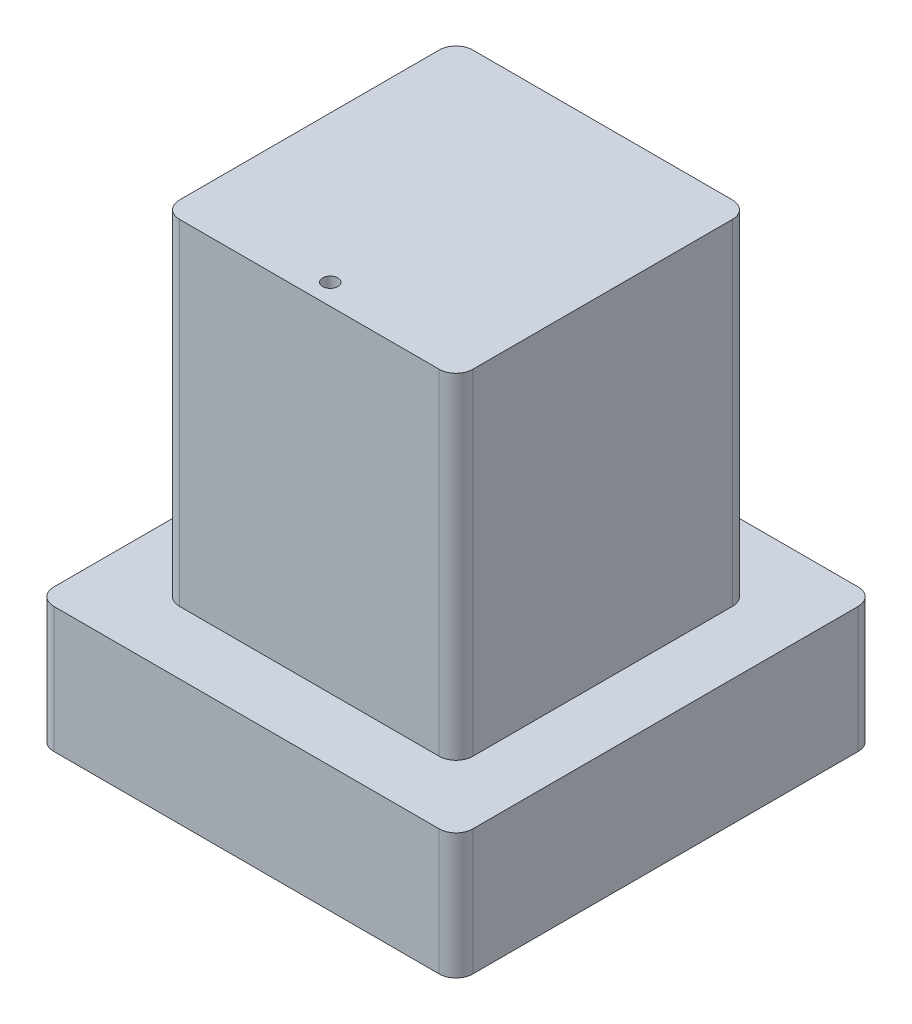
ISO-10303-21;
HEADER;
FILE_DESCRIPTION(('STEP AP214'),'2;1');
FILE_NAME('part.step','',(''),(''),'','','');
FILE_SCHEMA(('AUTOMOTIVE_DESIGN { 1 0 10303 214 1 1 1 1 }'));
ENDSEC;
DATA;
#1=APPLICATION_CONTEXT('core data for automotive mechanical design processes');
#2=APPLICATION_PROTOCOL_DEFINITION('international standard','automotive_design',2000,#1);
#3=PRODUCT_CONTEXT('',#1,'mechanical');
#4=PRODUCT('Part','Part','',(#3));
#5=PRODUCT_RELATED_PRODUCT_CATEGORY('part','',(#4));
#6=PRODUCT_DEFINITION_FORMATION('','',#4);
#7=PRODUCT_DEFINITION_CONTEXT('part definition',#1,'design');
#8=PRODUCT_DEFINITION('design','',#6,#7);
#9=PRODUCT_DEFINITION_SHAPE('','',#8);
#10=(LENGTH_UNIT() NAMED_UNIT(*) SI_UNIT(.MILLI.,.METRE.));
#11=(NAMED_UNIT(*) PLANE_ANGLE_UNIT() SI_UNIT($,.RADIAN.));
#12=(NAMED_UNIT(*) SI_UNIT($,.STERADIAN.) SOLID_ANGLE_UNIT());
#13=UNCERTAINTY_MEASURE_WITH_UNIT(LENGTH_MEASURE(1.E-05),#10,'distance_accuracy_value','');
#14=(GEOMETRIC_REPRESENTATION_CONTEXT(3) GLOBAL_UNCERTAINTY_ASSIGNED_CONTEXT((#13)) GLOBAL_UNIT_ASSIGNED_CONTEXT((#10,
#11,#12)) REPRESENTATION_CONTEXT('',''));
#15=CARTESIAN_POINT('',(0.,0.,0.));
#16=DIRECTION('',(0.,0.,1.));
#17=DIRECTION('',(1.,0.,0.));
#18=AXIS2_PLACEMENT_3D('',#15,#16,#17);
#19=CARTESIAN_POINT('',(-44.45,139.7,-44.45));
#20=DIRECTION('',(1.,0.,0.));
#21=DIRECTION('',(0.,0.,-1.));
#22=AXIS2_PLACEMENT_3D('',#19,#20,#21);
#23=PLANE('',#22);
#24=DIRECTION('',(0.,0.,1.));
#25=VECTOR('',#24,1.);
#26=CARTESIAN_POINT('',(-44.45,38.1,-44.45));
#27=LINE('',#26,#25);
#28=CARTESIAN_POINT('',(-44.45,38.1,-39.37));
#29=VERTEX_POINT('',#28);
#30=CARTESIAN_POINT('',(-44.45,38.1,39.37));
#31=VERTEX_POINT('',#30);
#32=EDGE_CURVE('E139',#29,#31,#27,.T.);
#33=ORIENTED_EDGE('',*,*,#32,.T.);
#34=DIRECTION('',(0.,-1.,0.));
#35=VECTOR('',#34,1.);
#36=CARTESIAN_POINT('',(-44.45,139.7,39.37));
#37=LINE('',#36,#35);
#38=CARTESIAN_POINT('',(-44.45,139.7,39.37));
#39=VERTEX_POINT('',#38);
#40=EDGE_CURVE('E162',#31,#39,#37,.F.);
#41=ORIENTED_EDGE('',*,*,#40,.T.);
#42=DIRECTION('',(0.,0.,1.));
#43=VECTOR('',#42,1.);
#44=CARTESIAN_POINT('',(-44.45,139.7,-44.45));
#45=LINE('',#44,#43);
#46=CARTESIAN_POINT('',(-44.45,139.7,-39.37));
#47=VERTEX_POINT('',#46);
#48=EDGE_CURVE('E137',#47,#39,#45,.T.);
#49=ORIENTED_EDGE('',*,*,#48,.F.);
#50=DIRECTION('',(0.,-1.,0.));
#51=VECTOR('',#50,1.);
#52=CARTESIAN_POINT('',(-44.45,139.7,-39.37));
#53=LINE('',#52,#51);
#54=EDGE_CURVE('E159',#47,#29,#53,.T.);
#55=ORIENTED_EDGE('',*,*,#54,.T.);
#56=EDGE_LOOP('',(#33,#41,#49,#55));
#57=FACE_BOUND('',#56,.T.);
#58=ADVANCED_FACE('F44',(#57),#23,.F.);
#59=CARTESIAN_POINT('',(44.45,139.7,44.45));
#60=DIRECTION('',(0.,0.,-1.));
#61=DIRECTION('',(-1.,0.,0.));
#62=AXIS2_PLACEMENT_3D('',#59,#60,#61);
#63=PLANE('',#62);
#64=DIRECTION('',(1.,0.,0.));
#65=VECTOR('',#64,1.);
#66=CARTESIAN_POINT('',(44.45,38.1,44.45));
#67=LINE('',#66,#65);
#68=CARTESIAN_POINT('',(-39.37,38.1,44.45));
#69=VERTEX_POINT('',#68);
#70=CARTESIAN_POINT('',(39.37,38.1,44.45));
#71=VERTEX_POINT('',#70);
#72=EDGE_CURVE('E135',#69,#71,#67,.T.);
#73=ORIENTED_EDGE('',*,*,#72,.T.);
#74=DIRECTION('',(0.,-1.,0.));
#75=VECTOR('',#74,1.);
#76=CARTESIAN_POINT('',(39.37,139.7,44.45));
#77=LINE('',#76,#75);
#78=CARTESIAN_POINT('',(39.37,139.7,44.45));
#79=VERTEX_POINT('',#78);
#80=EDGE_CURVE('E114',#71,#79,#77,.F.);
#81=ORIENTED_EDGE('',*,*,#80,.T.);
#82=DIRECTION('',(1.,0.,0.));
#83=VECTOR('',#82,1.);
#84=CARTESIAN_POINT('',(44.45,139.7,44.45));
#85=LINE('',#84,#83);
#86=CARTESIAN_POINT('',(-39.37,139.7,44.45));
#87=VERTEX_POINT('',#86);
#88=EDGE_CURVE('E178',#87,#79,#85,.T.);
#89=ORIENTED_EDGE('',*,*,#88,.F.);
#90=DIRECTION('',(0.,-1.,0.));
#91=VECTOR('',#90,1.);
#92=CARTESIAN_POINT('',(-39.37,139.7,44.45));
#93=LINE('',#92,#91);
#94=EDGE_CURVE('E119',#87,#69,#93,.T.);
#95=ORIENTED_EDGE('',*,*,#94,.T.);
#96=EDGE_LOOP('',(#73,#81,#89,#95));
#97=FACE_BOUND('',#96,.T.);
#98=ADVANCED_FACE('F202',(#97),#63,.F.);
#99=CARTESIAN_POINT('',(44.45,139.7,-44.45));
#100=DIRECTION('',(-1.,0.,0.));
#101=DIRECTION('',(0.,0.,1.));
#102=AXIS2_PLACEMENT_3D('',#99,#100,#101);
#103=PLANE('',#102);
#104=DIRECTION('',(0.,0.,-1.));
#105=VECTOR('',#104,1.);
#106=CARTESIAN_POINT('',(44.45,139.7,-44.45));
#107=LINE('',#106,#105);
#108=CARTESIAN_POINT('',(44.45,139.7,39.37));
#109=VERTEX_POINT('',#108);
#110=CARTESIAN_POINT('',(44.45,139.7,-39.37));
#111=VERTEX_POINT('',#110);
#112=EDGE_CURVE('E128',#109,#111,#107,.T.);
#113=ORIENTED_EDGE('',*,*,#112,.F.);
#114=DIRECTION('',(0.,-1.,0.));
#115=VECTOR('',#114,1.);
#116=CARTESIAN_POINT('',(44.45,139.7,39.37));
#117=LINE('',#116,#115);
#118=CARTESIAN_POINT('',(44.45,38.1,39.37));
#119=VERTEX_POINT('',#118);
#120=EDGE_CURVE('E113',#109,#119,#117,.T.);
#121=ORIENTED_EDGE('',*,*,#120,.T.);
#122=DIRECTION('',(0.,0.,-1.));
#123=VECTOR('',#122,1.);
#124=CARTESIAN_POINT('',(44.45,38.1,-44.45));
#125=LINE('',#124,#123);
#126=CARTESIAN_POINT('',(44.45,38.1,-39.37));
#127=VERTEX_POINT('',#126);
#128=EDGE_CURVE('E126',#119,#127,#125,.T.);
#129=ORIENTED_EDGE('',*,*,#128,.T.);
#130=DIRECTION('',(0.,-1.,0.));
#131=VECTOR('',#130,1.);
#132=CARTESIAN_POINT('',(44.45,139.7,-39.37));
#133=LINE('',#132,#131);
#134=EDGE_CURVE('E130',#127,#111,#133,.F.);
#135=ORIENTED_EDGE('',*,*,#134,.T.);
#136=EDGE_LOOP('',(#113,#121,#129,#135));
#137=FACE_BOUND('',#136,.T.);
#138=ADVANCED_FACE('F125',(#137),#103,.F.);
#139=CARTESIAN_POINT('',(44.45,139.7,-44.45));
#140=DIRECTION('',(0.,0.,1.));
#141=DIRECTION('',(1.,0.,0.));
#142=AXIS2_PLACEMENT_3D('',#139,#140,#141);
#143=PLANE('',#142);
#144=DIRECTION('',(-1.,0.,0.));
#145=VECTOR('',#144,1.);
#146=CARTESIAN_POINT('',(44.45,38.1,-44.45));
#147=LINE('',#146,#145);
#148=CARTESIAN_POINT('',(39.37,38.1,-44.45));
#149=VERTEX_POINT('',#148);
#150=CARTESIAN_POINT('',(-39.37,38.1,-44.45));
#151=VERTEX_POINT('',#150);
#152=EDGE_CURVE('E134',#149,#151,#147,.T.);
#153=ORIENTED_EDGE('',*,*,#152,.T.);
#154=DIRECTION('',(0.,-1.,0.));
#155=VECTOR('',#154,1.);
#156=CARTESIAN_POINT('',(-39.37,139.7,-44.45));
#157=LINE('',#156,#155);
#158=CARTESIAN_POINT('',(-39.37,139.7,-44.45));
#159=VERTEX_POINT('',#158);
#160=EDGE_CURVE('E12',#151,#159,#157,.F.);
#161=ORIENTED_EDGE('',*,*,#160,.T.);
#162=DIRECTION('',(-1.,0.,0.));
#163=VECTOR('',#162,1.);
#164=CARTESIAN_POINT('',(44.45,139.7,-44.45));
#165=LINE('',#164,#163);
#166=CARTESIAN_POINT('',(39.37,139.7,-44.45));
#167=VERTEX_POINT('',#166);
#168=EDGE_CURVE('E143',#167,#159,#165,.T.);
#169=ORIENTED_EDGE('',*,*,#168,.F.);
#170=DIRECTION('',(0.,-1.,0.));
#171=VECTOR('',#170,1.);
#172=CARTESIAN_POINT('',(39.37,139.7,-44.45));
#173=LINE('',#172,#171);
#174=EDGE_CURVE('E52',#167,#149,#173,.T.);
#175=ORIENTED_EDGE('',*,*,#174,.T.);
#176=EDGE_LOOP('',(#153,#161,#169,#175));
#177=FACE_BOUND('',#176,.T.);
#178=ADVANCED_FACE('F165',(#177),#143,.F.);
#179=CARTESIAN_POINT('',(0.,139.7,0.));
#180=DIRECTION('',(0.,-1.,0.));
#181=DIRECTION('',(0.,0.,-1.));
#182=AXIS2_PLACEMENT_3D('',#179,#180,#181);
#183=PLANE('',#182);
#184=CARTESIAN_POINT('',(0.,139.7,38.1));
#185=DIRECTION('',(0.,1.,0.));
#186=DIRECTION('',(0.,0.,1.));
#187=AXIS2_PLACEMENT_3D('',#184,#185,#186);
#188=CIRCLE('',#187,2.2987);
#189=CARTESIAN_POINT('',(0.,139.7,40.3987));
#190=VERTEX_POINT('',#189);
#191=EDGE_CURVE('E183',#190,#190,#188,.T.);
#192=ORIENTED_EDGE('',*,*,#191,.F.);
#193=EDGE_LOOP('',(#192));
#194=FACE_BOUND('',#193,.T.);
#195=ORIENTED_EDGE('',*,*,#88,.T.);
#196=CARTESIAN_POINT('',(39.37,139.7,39.37));
#197=DIRECTION('',(0.,-1.,0.));
#198=DIRECTION('',(0.,0.,-1.));
#199=AXIS2_PLACEMENT_3D('',#196,#197,#198);
#200=CIRCLE('',#199,5.08);
#201=EDGE_CURVE('E157',#79,#109,#200,.F.);
#202=ORIENTED_EDGE('',*,*,#201,.T.);
#203=ORIENTED_EDGE('',*,*,#112,.T.);
#204=CARTESIAN_POINT('',(39.37,139.7,-39.37));
#205=DIRECTION('',(0.,-1.,0.));
#206=DIRECTION('',(0.,0.,-1.));
#207=AXIS2_PLACEMENT_3D('',#204,#205,#206);
#208=CIRCLE('',#207,5.08);
#209=EDGE_CURVE('E64',#111,#167,#208,.F.);
#210=ORIENTED_EDGE('',*,*,#209,.T.);
#211=ORIENTED_EDGE('',*,*,#168,.T.);
#212=CARTESIAN_POINT('',(-39.37,139.7,-39.37));
#213=DIRECTION('',(0.,-1.,0.));
#214=DIRECTION('',(0.,0.,-1.));
#215=AXIS2_PLACEMENT_3D('',#212,#213,#214);
#216=CIRCLE('',#215,5.08);
#217=EDGE_CURVE('E153',#159,#47,#216,.F.);
#218=ORIENTED_EDGE('',*,*,#217,.T.);
#219=ORIENTED_EDGE('',*,*,#48,.T.);
#220=CARTESIAN_POINT('',(-39.37,139.7,39.37));
#221=DIRECTION('',(0.,-1.,0.));
#222=DIRECTION('',(0.,0.,-1.));
#223=AXIS2_PLACEMENT_3D('',#220,#221,#222);
#224=CIRCLE('',#223,5.08);
#225=EDGE_CURVE('E155',#39,#87,#224,.F.);
#226=ORIENTED_EDGE('',*,*,#225,.T.);
#227=EDGE_LOOP('',(#195,#202,#203,#210,#211,#218,#219,#226));
#228=FACE_BOUND('',#227,.T.);
#229=ADVANCED_FACE('F196',(#194,#228),#183,.F.);
#230=CARTESIAN_POINT('',(0.,38.1,0.));
#231=DIRECTION('',(0.,-1.,0.));
#232=DIRECTION('',(0.,0.,-1.));
#233=AXIS2_PLACEMENT_3D('',#230,#231,#232);
#234=PLANE('',#233);
#235=ORIENTED_EDGE('',*,*,#128,.F.);
#236=CARTESIAN_POINT('',(39.37,38.1,39.37));
#237=DIRECTION('',(0.,-1.,0.));
#238=DIRECTION('',(0.,0.,-1.));
#239=AXIS2_PLACEMENT_3D('',#236,#237,#238);
#240=CIRCLE('',#239,5.08);
#241=EDGE_CURVE('E109',#119,#71,#240,.T.);
#242=ORIENTED_EDGE('',*,*,#241,.T.);
#243=ORIENTED_EDGE('',*,*,#72,.F.);
#244=CARTESIAN_POINT('',(-39.37,38.1,39.37));
#245=DIRECTION('',(0.,-1.,0.));
#246=DIRECTION('',(0.,0.,-1.));
#247=AXIS2_PLACEMENT_3D('',#244,#245,#246);
#248=CIRCLE('',#247,5.08);
#249=EDGE_CURVE('E120',#69,#31,#248,.T.);
#250=ORIENTED_EDGE('',*,*,#249,.T.);
#251=ORIENTED_EDGE('',*,*,#32,.F.);
#252=CARTESIAN_POINT('',(-39.37,38.1,-39.37));
#253=DIRECTION('',(0.,-1.,0.));
#254=DIRECTION('',(0.,0.,-1.));
#255=AXIS2_PLACEMENT_3D('',#252,#253,#254);
#256=CIRCLE('',#255,5.08);
#257=EDGE_CURVE('E146',#29,#151,#256,.T.);
#258=ORIENTED_EDGE('',*,*,#257,.T.);
#259=ORIENTED_EDGE('',*,*,#152,.F.);
#260=CARTESIAN_POINT('',(39.37,38.1,-39.37));
#261=DIRECTION('',(0.,-1.,0.));
#262=DIRECTION('',(0.,0.,-1.));
#263=AXIS2_PLACEMENT_3D('',#260,#261,#262);
#264=CIRCLE('',#263,5.08);
#265=EDGE_CURVE('E129',#149,#127,#264,.T.);
#266=ORIENTED_EDGE('',*,*,#265,.T.);
#267=EDGE_LOOP('',(#235,#242,#243,#250,#251,#258,#259,#266));
#268=FACE_BOUND('',#267,.T.);
#269=ADVANCED_FACE('F132',(#268),#234,.T.);
#270=CARTESIAN_POINT('',(39.37,139.7,39.37));
#271=DIRECTION('',(0.,-1.,0.));
#272=DIRECTION('',(0.,0.,-1.));
#273=AXIS2_PLACEMENT_3D('',#270,#271,#272);
#274=CYLINDRICAL_SURFACE('',#273,5.08);
#275=ORIENTED_EDGE('',*,*,#201,.F.);
#276=ORIENTED_EDGE('',*,*,#80,.F.);
#277=ORIENTED_EDGE('',*,*,#241,.F.);
#278=ORIENTED_EDGE('',*,*,#120,.F.);
#279=EDGE_LOOP('',(#275,#276,#277,#278));
#280=FACE_BOUND('',#279,.T.);
#281=ADVANCED_FACE('F112',(#280),#274,.T.);
#282=CARTESIAN_POINT('',(-39.37,139.7,39.37));
#283=DIRECTION('',(0.,-1.,0.));
#284=DIRECTION('',(0.,0.,-1.));
#285=AXIS2_PLACEMENT_3D('',#282,#283,#284);
#286=CYLINDRICAL_SURFACE('',#285,5.08);
#287=ORIENTED_EDGE('',*,*,#225,.F.);
#288=ORIENTED_EDGE('',*,*,#40,.F.);
#289=ORIENTED_EDGE('',*,*,#249,.F.);
#290=ORIENTED_EDGE('',*,*,#94,.F.);
#291=EDGE_LOOP('',(#287,#288,#289,#290));
#292=FACE_BOUND('',#291,.T.);
#293=ADVANCED_FACE('F204',(#292),#286,.T.);
#294=CARTESIAN_POINT('',(-39.37,139.7,-39.37));
#295=DIRECTION('',(0.,-1.,0.));
#296=DIRECTION('',(0.,0.,-1.));
#297=AXIS2_PLACEMENT_3D('',#294,#295,#296);
#298=CYLINDRICAL_SURFACE('',#297,5.08);
#299=ORIENTED_EDGE('',*,*,#217,.F.);
#300=ORIENTED_EDGE('',*,*,#160,.F.);
#301=ORIENTED_EDGE('',*,*,#257,.F.);
#302=ORIENTED_EDGE('',*,*,#54,.F.);
#303=EDGE_LOOP('',(#299,#300,#301,#302));
#304=FACE_BOUND('',#303,.T.);
#305=ADVANCED_FACE('F172',(#304),#298,.T.);
#306=CARTESIAN_POINT('',(39.37,139.7,-39.37));
#307=DIRECTION('',(0.,-1.,0.));
#308=DIRECTION('',(0.,0.,-1.));
#309=AXIS2_PLACEMENT_3D('',#306,#307,#308);
#310=CYLINDRICAL_SURFACE('',#309,5.08);
#311=ORIENTED_EDGE('',*,*,#209,.F.);
#312=ORIENTED_EDGE('',*,*,#134,.F.);
#313=ORIENTED_EDGE('',*,*,#265,.F.);
#314=ORIENTED_EDGE('',*,*,#174,.F.);
#315=EDGE_LOOP('',(#311,#312,#313,#314));
#316=FACE_BOUND('',#315,.T.);
#317=ADVANCED_FACE('F46',(#316),#310,.T.);
#318=CARTESIAN_POINT('',(0.,133.35,38.1));
#319=DIRECTION('',(0.,1.,0.));
#320=DIRECTION('',(0.,0.,1.));
#321=AXIS2_PLACEMENT_3D('',#318,#319,#320);
#322=CYLINDRICAL_SURFACE('',#321,2.2987);
#323=CARTESIAN_POINT('',(0.,133.35,38.1));
#324=DIRECTION('',(0.,1.,0.));
#325=DIRECTION('',(0.,0.,1.));
#326=AXIS2_PLACEMENT_3D('',#323,#324,#325);
#327=CIRCLE('',#326,2.2987);
#328=CARTESIAN_POINT('',(0.,133.35,40.3987));
#329=VERTEX_POINT('',#328);
#330=EDGE_CURVE('E187',#329,#329,#327,.T.);
#331=ORIENTED_EDGE('',*,*,#330,.F.);
#332=EDGE_LOOP('',(#331));
#333=FACE_BOUND('',#332,.T.);
#334=ORIENTED_EDGE('',*,*,#191,.T.);
#335=EDGE_LOOP('',(#334));
#336=FACE_BOUND('',#335,.T.);
#337=ADVANCED_FACE('F194',(#333,#336),#322,.F.);
#338=CARTESIAN_POINT('',(0.,133.35,38.1));
#339=DIRECTION('',(0.,1.,0.));
#340=DIRECTION('',(0.,0.,1.));
#341=AXIS2_PLACEMENT_3D('',#338,#339,#340);
#342=PLANE('',#341);
#343=ORIENTED_EDGE('',*,*,#330,.T.);
#344=EDGE_LOOP('',(#343));
#345=FACE_BOUND('',#344,.T.);
#346=ADVANCED_FACE('F227',(#345),#342,.T.);
#347=CLOSED_SHELL('',(#58,#98,#138,#178,#229,#269,#281,#293,#305,#317,#337,#346));
#348=MANIFOLD_SOLID_BREP('B2',#347);
#349=CARTESIAN_POINT('',(-63.5,38.1,63.5));
#350=DIRECTION('',(1.,0.,0.));
#351=DIRECTION('',(0.,0.,-1.));
#352=AXIS2_PLACEMENT_3D('',#349,#350,#351);
#353=PLANE('',#352);
#354=DIRECTION('',(0.,0.,1.));
#355=VECTOR('',#354,1.);
#356=CARTESIAN_POINT('',(-63.5,38.1,63.5));
#357=LINE('',#356,#355);
#358=CARTESIAN_POINT('',(-63.5,38.1,-58.42));
#359=VERTEX_POINT('',#358);
#360=CARTESIAN_POINT('',(-63.5,38.1,58.42));
#361=VERTEX_POINT('',#360);
#362=EDGE_CURVE('E417',#359,#361,#357,.T.);
#363=ORIENTED_EDGE('',*,*,#362,.F.);
#364=DIRECTION('',(0.,-1.,0.));
#365=VECTOR('',#364,1.);
#366=CARTESIAN_POINT('',(-63.5,38.1,-58.42));
#367=LINE('',#366,#365);
#368=CARTESIAN_POINT('',(-63.5,0.,-58.42));
#369=VERTEX_POINT('',#368);
#370=EDGE_CURVE('E42',#359,#369,#367,.T.);
#371=ORIENTED_EDGE('',*,*,#370,.T.);
#372=DIRECTION('',(0.,0.,1.));
#373=VECTOR('',#372,1.);
#374=CARTESIAN_POINT('',(-63.5,0.,63.5));
#375=LINE('',#374,#373);
#376=CARTESIAN_POINT('',(-63.5,0.,58.42));
#377=VERTEX_POINT('',#376);
#378=EDGE_CURVE('E419',#369,#377,#375,.T.);
#379=ORIENTED_EDGE('',*,*,#378,.T.);
#380=DIRECTION('',(0.,-1.,0.));
#381=VECTOR('',#380,1.);
#382=CARTESIAN_POINT('',(-63.5,38.1,58.42));
#383=LINE('',#382,#381);
#384=EDGE_CURVE('E330',#377,#361,#383,.F.);
#385=ORIENTED_EDGE('',*,*,#384,.T.);
#386=EDGE_LOOP('',(#363,#371,#379,#385));
#387=FACE_BOUND('',#386,.T.);
#388=ADVANCED_FACE('F322',(#387),#353,.F.);
#389=CARTESIAN_POINT('',(63.5,38.1,63.5));
#390=DIRECTION('',(0.,0.,-1.));
#391=DIRECTION('',(-1.,0.,0.));
#392=AXIS2_PLACEMENT_3D('',#389,#390,#391);
#393=PLANE('',#392);
#394=DIRECTION('',(1.,0.,0.));
#395=VECTOR('',#394,1.);
#396=CARTESIAN_POINT('',(63.5,0.,63.5));
#397=LINE('',#396,#395);
#398=CARTESIAN_POINT('',(-58.42,0.,63.5));
#399=VERTEX_POINT('',#398);
#400=CARTESIAN_POINT('',(58.42,0.,63.5));
#401=VERTEX_POINT('',#400);
#402=EDGE_CURVE('E415',#399,#401,#397,.T.);
#403=ORIENTED_EDGE('',*,*,#402,.T.);
#404=DIRECTION('',(0.,-1.,0.));
#405=VECTOR('',#404,1.);
#406=CARTESIAN_POINT('',(58.42,38.1,63.5));
#407=LINE('',#406,#405);
#408=CARTESIAN_POINT('',(58.42,38.1,63.5));
#409=VERTEX_POINT('',#408);
#410=EDGE_CURVE('E394',#401,#409,#407,.F.);
#411=ORIENTED_EDGE('',*,*,#410,.T.);
#412=DIRECTION('',(1.,0.,0.));
#413=VECTOR('',#412,1.);
#414=CARTESIAN_POINT('',(63.5,38.1,63.5));
#415=LINE('',#414,#413);
#416=CARTESIAN_POINT('',(-58.42,38.1,63.5));
#417=VERTEX_POINT('',#416);
#418=EDGE_CURVE('E455',#417,#409,#415,.T.);
#419=ORIENTED_EDGE('',*,*,#418,.F.);
#420=DIRECTION('',(0.,-1.,0.));
#421=VECTOR('',#420,1.);
#422=CARTESIAN_POINT('',(-58.42,38.1,63.5));
#423=LINE('',#422,#421);
#424=EDGE_CURVE('E399',#417,#399,#423,.T.);
#425=ORIENTED_EDGE('',*,*,#424,.T.);
#426=EDGE_LOOP('',(#403,#411,#419,#425));
#427=FACE_BOUND('',#426,.T.);
#428=ADVANCED_FACE('F459',(#427),#393,.F.);
#429=CARTESIAN_POINT('',(63.5,38.1,63.5));
#430=DIRECTION('',(-1.,0.,0.));
#431=DIRECTION('',(0.,0.,1.));
#432=AXIS2_PLACEMENT_3D('',#429,#430,#431);
#433=PLANE('',#432);
#434=DIRECTION('',(0.,0.,-1.));
#435=VECTOR('',#434,1.);
#436=CARTESIAN_POINT('',(63.5,38.1,63.5));
#437=LINE('',#436,#435);
#438=CARTESIAN_POINT('',(63.5,38.1,58.42));
#439=VERTEX_POINT('',#438);
#440=CARTESIAN_POINT('',(63.5,38.1,-58.42));
#441=VERTEX_POINT('',#440);
#442=EDGE_CURVE('E408',#439,#441,#437,.T.);
#443=ORIENTED_EDGE('',*,*,#442,.F.);
#444=DIRECTION('',(0.,-1.,0.));
#445=VECTOR('',#444,1.);
#446=CARTESIAN_POINT('',(63.5,38.1,58.42));
#447=LINE('',#446,#445);
#448=CARTESIAN_POINT('',(63.5,0.,58.42));
#449=VERTEX_POINT('',#448);
#450=EDGE_CURVE('E393',#439,#449,#447,.T.);
#451=ORIENTED_EDGE('',*,*,#450,.T.);
#452=DIRECTION('',(0.,0.,-1.));
#453=VECTOR('',#452,1.);
#454=CARTESIAN_POINT('',(63.5,0.,63.5));
#455=LINE('',#454,#453);
#456=CARTESIAN_POINT('',(63.5,0.,-58.42));
#457=VERTEX_POINT('',#456);
#458=EDGE_CURVE('E406',#449,#457,#455,.T.);
#459=ORIENTED_EDGE('',*,*,#458,.T.);
#460=DIRECTION('',(0.,-1.,0.));
#461=VECTOR('',#460,1.);
#462=CARTESIAN_POINT('',(63.5,38.1,-58.42));
#463=LINE('',#462,#461);
#464=EDGE_CURVE('E410',#457,#441,#463,.F.);
#465=ORIENTED_EDGE('',*,*,#464,.T.);
#466=EDGE_LOOP('',(#443,#451,#459,#465));
#467=FACE_BOUND('',#466,.T.);
#468=ADVANCED_FACE('F405',(#467),#433,.F.);
#469=CARTESIAN_POINT('',(63.5,38.1,-63.5));
#470=DIRECTION('',(0.,0.,1.));
#471=DIRECTION('',(1.,0.,0.));
#472=AXIS2_PLACEMENT_3D('',#469,#470,#471);
#473=PLANE('',#472);
#474=DIRECTION('',(-1.,0.,0.));
#475=VECTOR('',#474,1.);
#476=CARTESIAN_POINT('',(63.5,38.1,-63.5));
#477=LINE('',#476,#475);
#478=CARTESIAN_POINT('',(58.42,38.1,-63.5));
#479=VERTEX_POINT('',#478);
#480=CARTESIAN_POINT('',(-58.42,38.1,-63.5));
#481=VERTEX_POINT('',#480);
#482=EDGE_CURVE('E423',#479,#481,#477,.T.);
#483=ORIENTED_EDGE('',*,*,#482,.F.);
#484=DIRECTION('',(0.,-1.,0.));
#485=VECTOR('',#484,1.);
#486=CARTESIAN_POINT('',(58.42,38.1,-63.5));
#487=LINE('',#486,#485);
#488=CARTESIAN_POINT('',(58.42,0.,-63.5));
#489=VERTEX_POINT('',#488);
#490=EDGE_CURVE('E440',#479,#489,#487,.T.);
#491=ORIENTED_EDGE('',*,*,#490,.T.);
#492=DIRECTION('',(-1.,0.,0.));
#493=VECTOR('',#492,1.);
#494=CARTESIAN_POINT('',(63.5,0.,-63.5));
#495=LINE('',#494,#493);
#496=CARTESIAN_POINT('',(-58.42,0.,-63.5));
#497=VERTEX_POINT('',#496);
#498=EDGE_CURVE('E414',#489,#497,#495,.T.);
#499=ORIENTED_EDGE('',*,*,#498,.T.);
#500=DIRECTION('',(0.,-1.,0.));
#501=VECTOR('',#500,1.);
#502=CARTESIAN_POINT('',(-58.42,38.1,-63.5));
#503=LINE('',#502,#501);
#504=EDGE_CURVE('E337',#497,#481,#503,.F.);
#505=ORIENTED_EDGE('',*,*,#504,.T.);
#506=EDGE_LOOP('',(#483,#491,#499,#505));
#507=FACE_BOUND('',#506,.T.);
#508=ADVANCED_FACE('F466',(#507),#473,.F.);
#509=CARTESIAN_POINT('',(0.,38.1,0.));
#510=DIRECTION('',(0.,1.,0.));
#511=DIRECTION('',(0.,0.,1.));
#512=AXIS2_PLACEMENT_3D('',#509,#510,#511);
#513=PLANE('',#512);
#514=ORIENTED_EDGE('',*,*,#418,.T.);
#515=CARTESIAN_POINT('',(58.42,38.1,58.42));
#516=DIRECTION('',(0.,1.,0.));
#517=DIRECTION('',(0.,0.,1.));
#518=AXIS2_PLACEMENT_3D('',#515,#516,#517);
#519=CIRCLE('',#518,5.08);
#520=EDGE_CURVE('E437',#409,#439,#519,.T.);
#521=ORIENTED_EDGE('',*,*,#520,.T.);
#522=ORIENTED_EDGE('',*,*,#442,.T.);
#523=CARTESIAN_POINT('',(58.42,38.1,-58.42));
#524=DIRECTION('',(0.,1.,0.));
#525=DIRECTION('',(0.,0.,1.));
#526=AXIS2_PLACEMENT_3D('',#523,#524,#525);
#527=CIRCLE('',#526,5.08);
#528=EDGE_CURVE('E344',#441,#479,#527,.T.);
#529=ORIENTED_EDGE('',*,*,#528,.T.);
#530=ORIENTED_EDGE('',*,*,#482,.T.);
#531=CARTESIAN_POINT('',(-58.42,38.1,-58.42));
#532=DIRECTION('',(0.,1.,0.));
#533=DIRECTION('',(0.,0.,1.));
#534=AXIS2_PLACEMENT_3D('',#531,#532,#533);
#535=CIRCLE('',#534,5.08);
#536=EDGE_CURVE('E434',#481,#359,#535,.T.);
#537=ORIENTED_EDGE('',*,*,#536,.T.);
#538=ORIENTED_EDGE('',*,*,#362,.T.);
#539=CARTESIAN_POINT('',(-58.42,38.1,58.42));
#540=DIRECTION('',(0.,1.,0.));
#541=DIRECTION('',(0.,0.,1.));
#542=AXIS2_PLACEMENT_3D('',#539,#540,#541);
#543=CIRCLE('',#542,5.08);
#544=EDGE_CURVE('E432',#361,#417,#543,.T.);
#545=ORIENTED_EDGE('',*,*,#544,.T.);
#546=EDGE_LOOP('',(#514,#521,#522,#529,#530,#537,#538,#545));
#547=FACE_BOUND('',#546,.T.);
#548=ADVANCED_FACE('F452',(#547),#513,.T.);
#549=CARTESIAN_POINT('',(0.,0.,0.));
#550=DIRECTION('',(0.,1.,0.));
#551=DIRECTION('',(0.,0.,1.));
#552=AXIS2_PLACEMENT_3D('',#549,#550,#551);
#553=PLANE('',#552);
#554=ORIENTED_EDGE('',*,*,#458,.F.);
#555=CARTESIAN_POINT('',(58.42,0.,58.42));
#556=DIRECTION('',(0.,1.,0.));
#557=DIRECTION('',(0.,0.,1.));
#558=AXIS2_PLACEMENT_3D('',#555,#556,#557);
#559=CIRCLE('',#558,5.08);
#560=EDGE_CURVE('E389',#449,#401,#559,.F.);
#561=ORIENTED_EDGE('',*,*,#560,.T.);
#562=ORIENTED_EDGE('',*,*,#402,.F.);
#563=CARTESIAN_POINT('',(-58.42,0.,58.42));
#564=DIRECTION('',(0.,1.,0.));
#565=DIRECTION('',(0.,0.,1.));
#566=AXIS2_PLACEMENT_3D('',#563,#564,#565);
#567=CIRCLE('',#566,5.08);
#568=EDGE_CURVE('E409',#399,#377,#567,.F.);
#569=ORIENTED_EDGE('',*,*,#568,.T.);
#570=ORIENTED_EDGE('',*,*,#378,.F.);
#571=CARTESIAN_POINT('',(-58.42,0.,-58.42));
#572=DIRECTION('',(0.,1.,0.));
#573=DIRECTION('',(0.,0.,1.));
#574=AXIS2_PLACEMENT_3D('',#571,#572,#573);
#575=CIRCLE('',#574,5.08);
#576=EDGE_CURVE('E426',#369,#497,#575,.F.);
#577=ORIENTED_EDGE('',*,*,#576,.T.);
#578=ORIENTED_EDGE('',*,*,#498,.F.);
#579=CARTESIAN_POINT('',(58.42,0.,-58.42));
#580=DIRECTION('',(0.,1.,0.));
#581=DIRECTION('',(0.,0.,1.));
#582=AXIS2_PLACEMENT_3D('',#579,#580,#581);
#583=CIRCLE('',#582,5.08);
#584=EDGE_CURVE('E400',#489,#457,#583,.F.);
#585=ORIENTED_EDGE('',*,*,#584,.T.);
#586=EDGE_LOOP('',(#554,#561,#562,#569,#570,#577,#578,#585));
#587=FACE_BOUND('',#586,.T.);
#588=ADVANCED_FACE('F412',(#587),#553,.F.);
#589=CARTESIAN_POINT('',(58.42,38.1,58.42));
#590=DIRECTION('',(0.,-1.,0.));
#591=DIRECTION('',(0.,0.,-1.));
#592=AXIS2_PLACEMENT_3D('',#589,#590,#591);
#593=CYLINDRICAL_SURFACE('',#592,5.08);
#594=ORIENTED_EDGE('',*,*,#520,.F.);
#595=ORIENTED_EDGE('',*,*,#410,.F.);
#596=ORIENTED_EDGE('',*,*,#560,.F.);
#597=ORIENTED_EDGE('',*,*,#450,.F.);
#598=EDGE_LOOP('',(#594,#595,#596,#597));
#599=FACE_BOUND('',#598,.T.);
#600=ADVANCED_FACE('F392',(#599),#593,.T.);
#601=CARTESIAN_POINT('',(58.42,38.1,-58.42));
#602=DIRECTION('',(0.,-1.,0.));
#603=DIRECTION('',(0.,0.,-1.));
#604=AXIS2_PLACEMENT_3D('',#601,#602,#603);
#605=CYLINDRICAL_SURFACE('',#604,5.08);
#606=ORIENTED_EDGE('',*,*,#528,.F.);
#607=ORIENTED_EDGE('',*,*,#464,.F.);
#608=ORIENTED_EDGE('',*,*,#584,.F.);
#609=ORIENTED_EDGE('',*,*,#490,.F.);
#610=EDGE_LOOP('',(#606,#607,#608,#609));
#611=FACE_BOUND('',#610,.T.);
#612=ADVANCED_FACE('F465',(#611),#605,.T.);
#613=CARTESIAN_POINT('',(-58.42,38.1,-58.42));
#614=DIRECTION('',(0.,-1.,0.));
#615=DIRECTION('',(0.,0.,-1.));
#616=AXIS2_PLACEMENT_3D('',#613,#614,#615);
#617=CYLINDRICAL_SURFACE('',#616,5.08);
#618=ORIENTED_EDGE('',*,*,#536,.F.);
#619=ORIENTED_EDGE('',*,*,#504,.F.);
#620=ORIENTED_EDGE('',*,*,#576,.F.);
#621=ORIENTED_EDGE('',*,*,#370,.F.);
#622=EDGE_LOOP('',(#618,#619,#620,#621));
#623=FACE_BOUND('',#622,.T.);
#624=ADVANCED_FACE('F468',(#623),#617,.T.);
#625=CARTESIAN_POINT('',(-58.42,38.1,58.42));
#626=DIRECTION('',(0.,-1.,0.));
#627=DIRECTION('',(0.,0.,-1.));
#628=AXIS2_PLACEMENT_3D('',#625,#626,#627);
#629=CYLINDRICAL_SURFACE('',#628,5.08);
#630=ORIENTED_EDGE('',*,*,#544,.F.);
#631=ORIENTED_EDGE('',*,*,#384,.F.);
#632=ORIENTED_EDGE('',*,*,#568,.F.);
#633=ORIENTED_EDGE('',*,*,#424,.F.);
#634=EDGE_LOOP('',(#630,#631,#632,#633));
#635=FACE_BOUND('',#634,.T.);
#636=ADVANCED_FACE('F324',(#635),#629,.T.);
#637=CLOSED_SHELL('',(#388,#428,#468,#508,#548,#588,#600,#612,#624,#636));
#638=MANIFOLD_SOLID_BREP('B6',#637);
#639=ADVANCED_BREP_SHAPE_REPRESENTATION('',(#18,#348,#638),#14);
#640=SHAPE_DEFINITION_REPRESENTATION(#9,#639);
ENDSEC;
END-ISO-10303-21;
